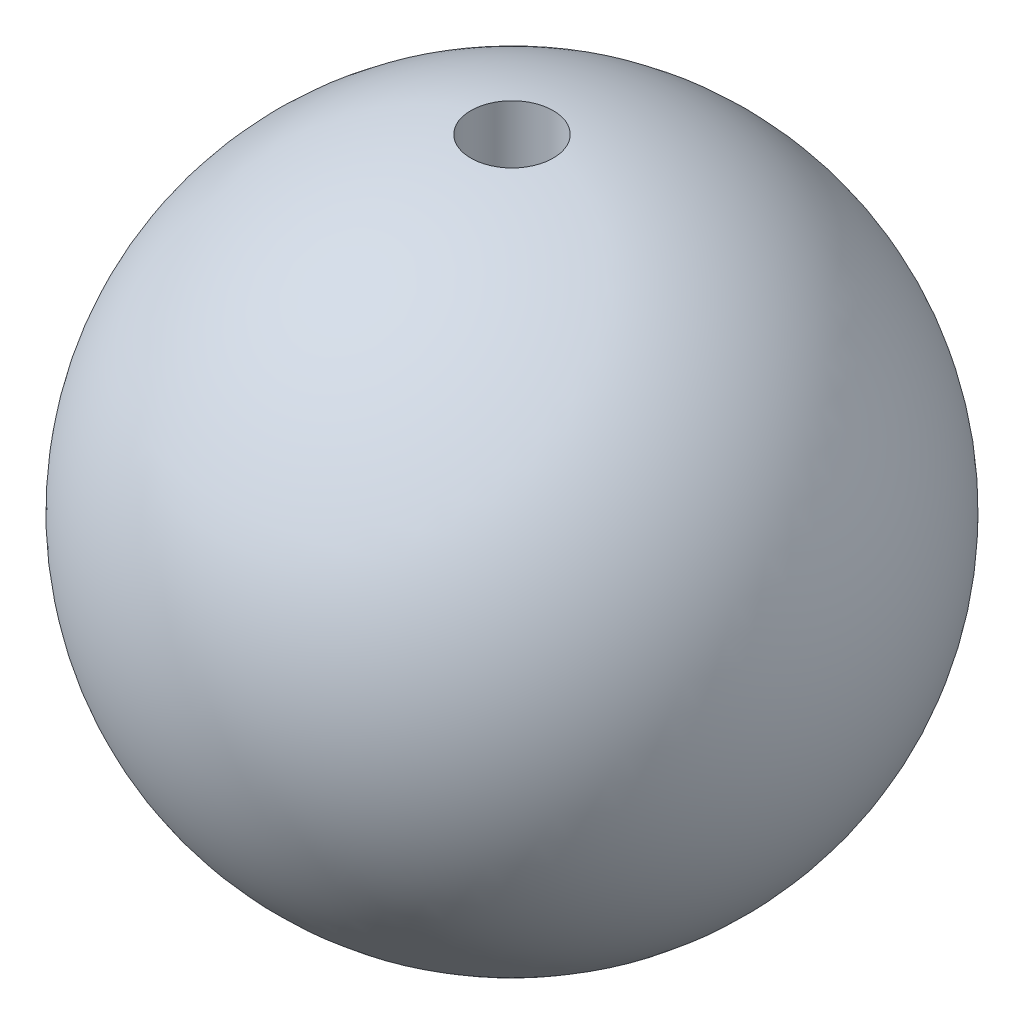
from build123d import *

# Parameters (mm, degrees)
SKETCH3_R          = 1.5875
CUT_EXTRUDE1_DEPTH = 22.997045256


with BuildPart() as part:
    # Sketch2 → Revolve1 (revolve)
    with BuildSketch(Plane.XY):
        with BuildLine():
            Line((0, 12.7), (0, -12.7))
            ThreePointArc((0, -12.7), (12.7, 0), (0, 12.7))
        make_face()
    revolve(axis=Axis((0, 0, 0), (0, 1, 0)))

    # Sketch3 → Cut-Extrude1 (cut, through all)
    with BuildSketch(Plane(origin=(0, 0, 0), x_dir=(1, 0, 0), z_dir=(0, 1, 0))):
        with Locations(Location((0, 0, 0), (0, 0, 90))):
            Circle(SKETCH3_R)
    extrude(amount=CUT_EXTRUDE1_DEPTH, mode=Mode.SUBTRACT)


solid = part.part
